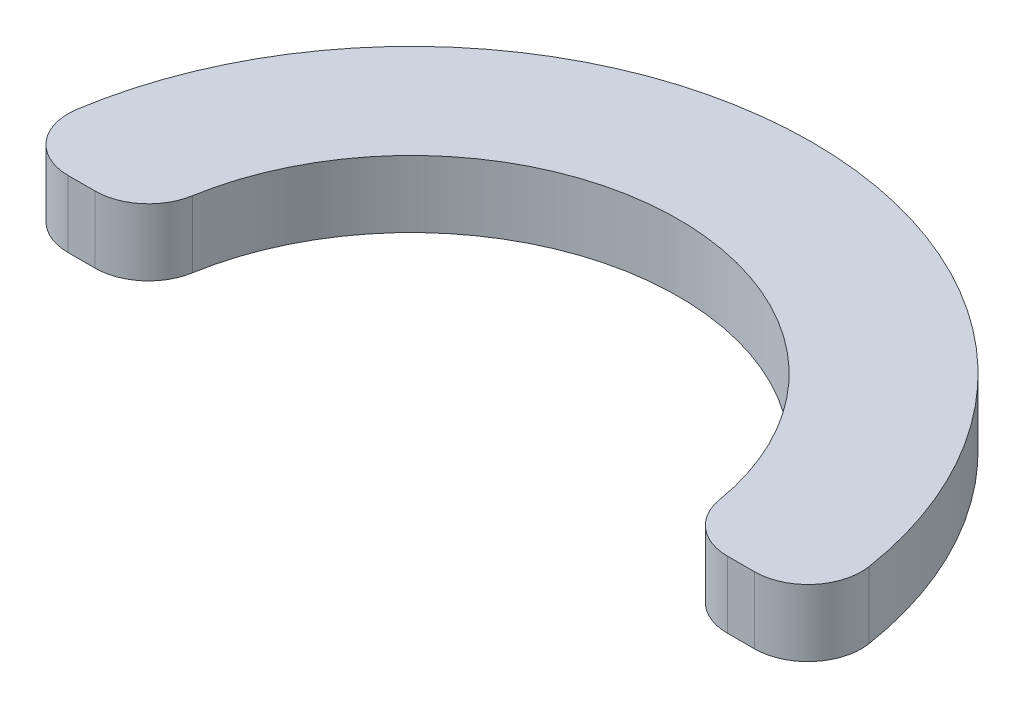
ISO-10303-21;
HEADER;
FILE_DESCRIPTION(('STEP AP214'),'2;1');
FILE_NAME('part.step','',(''),(''),'','','');
FILE_SCHEMA(('AUTOMOTIVE_DESIGN { 1 0 10303 214 1 1 1 1 }'));
ENDSEC;
DATA;
#1=APPLICATION_CONTEXT('core data for automotive mechanical design processes');
#2=APPLICATION_PROTOCOL_DEFINITION('international standard','automotive_design',2000,#1);
#3=PRODUCT_CONTEXT('',#1,'mechanical');
#4=PRODUCT('Part','Part','',(#3));
#5=PRODUCT_RELATED_PRODUCT_CATEGORY('part','',(#4));
#6=PRODUCT_DEFINITION_FORMATION('','',#4);
#7=PRODUCT_DEFINITION_CONTEXT('part definition',#1,'design');
#8=PRODUCT_DEFINITION('design','',#6,#7);
#9=PRODUCT_DEFINITION_SHAPE('','',#8);
#10=(LENGTH_UNIT() NAMED_UNIT(*) SI_UNIT(.MILLI.,.METRE.));
#11=(NAMED_UNIT(*) PLANE_ANGLE_UNIT() SI_UNIT($,.RADIAN.));
#12=(NAMED_UNIT(*) SI_UNIT($,.STERADIAN.) SOLID_ANGLE_UNIT());
#13=UNCERTAINTY_MEASURE_WITH_UNIT(LENGTH_MEASURE(1.E-05),#10,'distance_accuracy_value','');
#14=(GEOMETRIC_REPRESENTATION_CONTEXT(3) GLOBAL_UNCERTAINTY_ASSIGNED_CONTEXT((#13)) GLOBAL_UNIT_ASSIGNED_CONTEXT((#10,
#11,#12)) REPRESENTATION_CONTEXT('',''));
#15=CARTESIAN_POINT('',(0.,0.,0.));
#16=DIRECTION('',(0.,0.,1.));
#17=DIRECTION('',(1.,0.,0.));
#18=AXIS2_PLACEMENT_3D('',#15,#16,#17);
#19=CARTESIAN_POINT('',(0.,3.175,0.));
#20=DIRECTION('',(0.,-1.,0.));
#21=DIRECTION('',(0.,0.,-1.));
#22=AXIS2_PLACEMENT_3D('',#19,#20,#21);
#23=CYLINDRICAL_SURFACE('',#22,12.7);
#24=CARTESIAN_POINT('',(0.,3.175,0.));
#25=DIRECTION('',(0.,-1.,0.));
#26=DIRECTION('',(0.,0.,1.));
#27=AXIS2_PLACEMENT_3D('',#24,#25,#26);
#28=CIRCLE('',#27,12.7);
#29=CARTESIAN_POINT('',(-12.5223688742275,3.175,-2.11666666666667));
#30=VERTEX_POINT('',#29);
#31=CARTESIAN_POINT('',(12.5223688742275,3.175,-2.11666666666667));
#32=VERTEX_POINT('',#31);
#33=EDGE_CURVE('E140',#30,#32,#28,.T.);
#34=ORIENTED_EDGE('',*,*,#33,.F.);
#35=DIRECTION('',(0.,-1.,0.));
#36=VECTOR('',#35,1.);
#37=CARTESIAN_POINT('',(-12.5223688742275,3.175,-2.11666666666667));
#38=LINE('',#37,#36);
#39=CARTESIAN_POINT('',(-12.5223688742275,0.,-2.11666666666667));
#40=VERTEX_POINT('',#39);
#41=EDGE_CURVE('E179',#30,#40,#38,.T.);
#42=ORIENTED_EDGE('',*,*,#41,.T.);
#43=CARTESIAN_POINT('',(0.,0.,0.));
#44=DIRECTION('',(0.,-1.,0.));
#45=DIRECTION('',(0.,0.,1.));
#46=AXIS2_PLACEMENT_3D('',#43,#44,#45);
#47=CIRCLE('',#46,12.7);
#48=CARTESIAN_POINT('',(12.5223688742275,0.,-2.11666666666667));
#49=VERTEX_POINT('',#48);
#50=EDGE_CURVE('E193',#40,#49,#47,.T.);
#51=ORIENTED_EDGE('',*,*,#50,.T.);
#52=DIRECTION('',(0.,-1.,0.));
#53=VECTOR('',#52,1.);
#54=CARTESIAN_POINT('',(12.5223688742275,3.175,-2.11666666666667));
#55=LINE('',#54,#53);
#56=EDGE_CURVE('E176',#49,#32,#55,.F.);
#57=ORIENTED_EDGE('',*,*,#56,.T.);
#58=EDGE_LOOP('',(#34,#42,#51,#57));
#59=FACE_BOUND('',#58,.T.);
#60=ADVANCED_FACE('F44',(#59),#23,.F.);
#61=CARTESIAN_POINT('',(12.7,3.175,0.));
#62=DIRECTION('',(0.,0.,-1.));
#63=DIRECTION('',(-1.,0.,0.));
#64=AXIS2_PLACEMENT_3D('',#61,#62,#63);
#65=PLANE('',#64);
#66=DIRECTION('',(1.,0.,0.));
#67=VECTOR('',#66,1.);
#68=CARTESIAN_POINT('',(12.7,3.175,0.));
#69=LINE('',#68,#67);
#70=CARTESIAN_POINT('',(15.026842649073,3.175,0.));
#71=VERTEX_POINT('',#70);
#72=CARTESIAN_POINT('',(16.3134453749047,3.175,0.));
#73=VERTEX_POINT('',#72);
#74=EDGE_CURVE('E145',#71,#73,#69,.T.);
#75=ORIENTED_EDGE('',*,*,#74,.F.);
#76=DIRECTION('',(0.,-1.,0.));
#77=VECTOR('',#76,1.);
#78=CARTESIAN_POINT('',(15.026842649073,3.175,0.));
#79=LINE('',#78,#77);
#80=CARTESIAN_POINT('',(15.026842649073,0.,0.));
#81=VERTEX_POINT('',#80);
#82=EDGE_CURVE('E11',#71,#81,#79,.T.);
#83=ORIENTED_EDGE('',*,*,#82,.T.);
#84=DIRECTION('',(1.,0.,0.));
#85=VECTOR('',#84,1.);
#86=CARTESIAN_POINT('',(12.7,0.,0.));
#87=LINE('',#86,#85);
#88=CARTESIAN_POINT('',(16.3134453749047,0.,0.));
#89=VERTEX_POINT('',#88);
#90=EDGE_CURVE('E147',#81,#89,#87,.T.);
#91=ORIENTED_EDGE('',*,*,#90,.T.);
#92=DIRECTION('',(0.,-1.,0.));
#93=VECTOR('',#92,1.);
#94=CARTESIAN_POINT('',(16.3134453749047,3.175,0.));
#95=LINE('',#94,#93);
#96=EDGE_CURVE('E53',#89,#73,#95,.F.);
#97=ORIENTED_EDGE('',*,*,#96,.T.);
#98=EDGE_LOOP('',(#75,#83,#91,#97));
#99=FACE_BOUND('',#98,.T.);
#100=ADVANCED_FACE('F198',(#99),#65,.F.);
#101=CARTESIAN_POINT('',(0.,3.175,0.));
#102=DIRECTION('',(0.,-1.,0.));
#103=DIRECTION('',(0.,0.,-1.));
#104=AXIS2_PLACEMENT_3D('',#101,#102,#103);
#105=CYLINDRICAL_SURFACE('',#104,19.05);
#106=CARTESIAN_POINT('',(0.,0.,0.));
#107=DIRECTION('',(0.,1.,0.));
#108=DIRECTION('',(0.,0.,1.));
#109=AXIS2_PLACEMENT_3D('',#106,#107,#108);
#110=CIRCLE('',#109,19.05);
#111=CARTESIAN_POINT('',(18.8232062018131,0.,-2.93076923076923));
#112=VERTEX_POINT('',#111);
#113=CARTESIAN_POINT('',(-18.8232062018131,0.,-2.93076923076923));
#114=VERTEX_POINT('',#113);
#115=EDGE_CURVE('E141',#112,#114,#110,.T.);
#116=ORIENTED_EDGE('',*,*,#115,.T.);
#117=DIRECTION('',(0.,-1.,0.));
#118=VECTOR('',#117,1.);
#119=CARTESIAN_POINT('',(-18.8232062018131,3.175,-2.93076923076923));
#120=LINE('',#119,#118);
#121=CARTESIAN_POINT('',(-18.8232062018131,3.175,-2.93076923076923));
#122=VERTEX_POINT('',#121);
#123=EDGE_CURVE('E116',#114,#122,#120,.F.);
#124=ORIENTED_EDGE('',*,*,#123,.T.);
#125=CARTESIAN_POINT('',(0.,3.175,0.));
#126=DIRECTION('',(0.,1.,0.));
#127=DIRECTION('',(0.,0.,1.));
#128=AXIS2_PLACEMENT_3D('',#125,#126,#127);
#129=CIRCLE('',#128,19.05);
#130=CARTESIAN_POINT('',(18.8232062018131,3.175,-2.93076923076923));
#131=VERTEX_POINT('',#130);
#132=EDGE_CURVE('E185',#131,#122,#129,.T.);
#133=ORIENTED_EDGE('',*,*,#132,.F.);
#134=DIRECTION('',(0.,-1.,0.));
#135=VECTOR('',#134,1.);
#136=CARTESIAN_POINT('',(18.8232062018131,3.175,-2.93076923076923));
#137=LINE('',#136,#135);
#138=EDGE_CURVE('E122',#131,#112,#137,.T.);
#139=ORIENTED_EDGE('',*,*,#138,.T.);
#140=EDGE_LOOP('',(#116,#124,#133,#139));
#141=FACE_BOUND('',#140,.T.);
#142=ADVANCED_FACE('F205',(#141),#105,.T.);
#143=CARTESIAN_POINT('',(-12.7,3.175,0.));
#144=DIRECTION('',(0.,0.,-1.));
#145=DIRECTION('',(-1.,0.,0.));
#146=AXIS2_PLACEMENT_3D('',#143,#144,#145);
#147=PLANE('',#146);
#148=DIRECTION('',(1.,0.,0.));
#149=VECTOR('',#148,1.);
#150=CARTESIAN_POINT('',(-12.7,3.175,0.));
#151=LINE('',#150,#149);
#152=CARTESIAN_POINT('',(-16.3134453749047,3.175,0.));
#153=VERTEX_POINT('',#152);
#154=CARTESIAN_POINT('',(-15.026842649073,3.175,0.));
#155=VERTEX_POINT('',#154);
#156=EDGE_CURVE('E132',#153,#155,#151,.T.);
#157=ORIENTED_EDGE('',*,*,#156,.F.);
#158=DIRECTION('',(0.,-1.,0.));
#159=VECTOR('',#158,1.);
#160=CARTESIAN_POINT('',(-16.3134453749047,3.175,0.));
#161=LINE('',#160,#159);
#162=CARTESIAN_POINT('',(-16.3134453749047,0.,0.));
#163=VERTEX_POINT('',#162);
#164=EDGE_CURVE('E115',#153,#163,#161,.T.);
#165=ORIENTED_EDGE('',*,*,#164,.T.);
#166=DIRECTION('',(1.,0.,0.));
#167=VECTOR('',#166,1.);
#168=CARTESIAN_POINT('',(-12.7,0.,0.));
#169=LINE('',#168,#167);
#170=CARTESIAN_POINT('',(-15.026842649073,0.,0.));
#171=VERTEX_POINT('',#170);
#172=EDGE_CURVE('E129',#163,#171,#169,.T.);
#173=ORIENTED_EDGE('',*,*,#172,.T.);
#174=DIRECTION('',(0.,-1.,0.));
#175=VECTOR('',#174,1.);
#176=CARTESIAN_POINT('',(-15.026842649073,3.175,0.));
#177=LINE('',#176,#175);
#178=EDGE_CURVE('E135',#171,#155,#177,.F.);
#179=ORIENTED_EDGE('',*,*,#178,.T.);
#180=EDGE_LOOP('',(#157,#165,#173,#179));
#181=FACE_BOUND('',#180,.T.);
#182=ADVANCED_FACE('F128',(#181),#147,.F.);
#183=CARTESIAN_POINT('',(0.,3.175,0.));
#184=DIRECTION('',(0.,1.,0.));
#185=DIRECTION('',(0.,0.,1.));
#186=AXIS2_PLACEMENT_3D('',#183,#184,#185);
#187=PLANE('',#186);
#188=ORIENTED_EDGE('',*,*,#132,.T.);
#189=CARTESIAN_POINT('',(-16.3134453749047,3.175,-2.54));
#190=DIRECTION('',(0.,1.,0.));
#191=DIRECTION('',(0.,0.,1.));
#192=AXIS2_PLACEMENT_3D('',#189,#190,#191);
#193=CIRCLE('',#192,2.54);
#194=EDGE_CURVE('E173',#122,#153,#193,.T.);
#195=ORIENTED_EDGE('',*,*,#194,.T.);
#196=ORIENTED_EDGE('',*,*,#156,.T.);
#197=CARTESIAN_POINT('',(-15.026842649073,3.175,-2.54));
#198=DIRECTION('',(0.,1.,0.));
#199=DIRECTION('',(0.,0.,1.));
#200=AXIS2_PLACEMENT_3D('',#197,#198,#199);
#201=CIRCLE('',#200,2.54);
#202=EDGE_CURVE('E170',#155,#30,#201,.T.);
#203=ORIENTED_EDGE('',*,*,#202,.T.);
#204=ORIENTED_EDGE('',*,*,#33,.T.);
#205=CARTESIAN_POINT('',(15.026842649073,3.175,-2.54));
#206=DIRECTION('',(0.,1.,0.));
#207=DIRECTION('',(0.,0.,1.));
#208=AXIS2_PLACEMENT_3D('',#205,#206,#207);
#209=CIRCLE('',#208,2.54);
#210=EDGE_CURVE('E66',#32,#71,#209,.T.);
#211=ORIENTED_EDGE('',*,*,#210,.T.);
#212=ORIENTED_EDGE('',*,*,#74,.T.);
#213=CARTESIAN_POINT('',(16.3134453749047,3.175,-2.54));
#214=DIRECTION('',(0.,1.,0.));
#215=DIRECTION('',(0.,0.,1.));
#216=AXIS2_PLACEMENT_3D('',#213,#214,#215);
#217=CIRCLE('',#216,2.54);
#218=EDGE_CURVE('E165',#73,#131,#217,.T.);
#219=ORIENTED_EDGE('',*,*,#218,.T.);
#220=EDGE_LOOP('',(#188,#195,#196,#203,#204,#211,#212,#219));
#221=FACE_BOUND('',#220,.T.);
#222=ADVANCED_FACE('F203',(#221),#187,.T.);
#223=CARTESIAN_POINT('',(0.,0.,0.));
#224=DIRECTION('',(0.,1.,0.));
#225=DIRECTION('',(0.,0.,1.));
#226=AXIS2_PLACEMENT_3D('',#223,#224,#225);
#227=PLANE('',#226);
#228=ORIENTED_EDGE('',*,*,#172,.F.);
#229=CARTESIAN_POINT('',(-16.3134453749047,0.,-2.54));
#230=DIRECTION('',(0.,1.,0.));
#231=DIRECTION('',(0.,0.,1.));
#232=AXIS2_PLACEMENT_3D('',#229,#230,#231);
#233=CIRCLE('',#232,2.54);
#234=EDGE_CURVE('E111',#163,#114,#233,.F.);
#235=ORIENTED_EDGE('',*,*,#234,.T.);
#236=ORIENTED_EDGE('',*,*,#115,.F.);
#237=CARTESIAN_POINT('',(16.3134453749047,0.,-2.54));
#238=DIRECTION('',(0.,1.,0.));
#239=DIRECTION('',(0.,0.,1.));
#240=AXIS2_PLACEMENT_3D('',#237,#238,#239);
#241=CIRCLE('',#240,2.54);
#242=EDGE_CURVE('E134',#112,#89,#241,.F.);
#243=ORIENTED_EDGE('',*,*,#242,.T.);
#244=ORIENTED_EDGE('',*,*,#90,.F.);
#245=CARTESIAN_POINT('',(15.026842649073,0.,-2.54));
#246=DIRECTION('',(0.,1.,0.));
#247=DIRECTION('',(0.,0.,1.));
#248=AXIS2_PLACEMENT_3D('',#245,#246,#247);
#249=CIRCLE('',#248,2.54);
#250=EDGE_CURVE('E155',#81,#49,#249,.F.);
#251=ORIENTED_EDGE('',*,*,#250,.T.);
#252=ORIENTED_EDGE('',*,*,#50,.F.);
#253=CARTESIAN_POINT('',(-15.026842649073,0.,-2.54));
#254=DIRECTION('',(0.,1.,0.));
#255=DIRECTION('',(0.,0.,1.));
#256=AXIS2_PLACEMENT_3D('',#253,#254,#255);
#257=CIRCLE('',#256,2.54);
#258=EDGE_CURVE('E123',#40,#171,#257,.F.);
#259=ORIENTED_EDGE('',*,*,#258,.T.);
#260=EDGE_LOOP('',(#228,#235,#236,#243,#244,#251,#252,#259));
#261=FACE_BOUND('',#260,.T.);
#262=ADVANCED_FACE('F137',(#261),#227,.F.);
#263=CARTESIAN_POINT('',(-16.3134453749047,3.175,-2.54));
#264=DIRECTION('',(0.,-1.,0.));
#265=DIRECTION('',(0.,0.,-1.));
#266=AXIS2_PLACEMENT_3D('',#263,#264,#265);
#267=CYLINDRICAL_SURFACE('',#266,2.54);
#268=ORIENTED_EDGE('',*,*,#194,.F.);
#269=ORIENTED_EDGE('',*,*,#123,.F.);
#270=ORIENTED_EDGE('',*,*,#234,.F.);
#271=ORIENTED_EDGE('',*,*,#164,.F.);
#272=EDGE_LOOP('',(#268,#269,#270,#271));
#273=FACE_BOUND('',#272,.T.);
#274=ADVANCED_FACE('F114',(#273),#267,.T.);
#275=CARTESIAN_POINT('',(-15.026842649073,3.175,-2.54));
#276=DIRECTION('',(0.,-1.,0.));
#277=DIRECTION('',(0.,0.,-1.));
#278=AXIS2_PLACEMENT_3D('',#275,#276,#277);
#279=CYLINDRICAL_SURFACE('',#278,2.54);
#280=ORIENTED_EDGE('',*,*,#202,.F.);
#281=ORIENTED_EDGE('',*,*,#178,.F.);
#282=ORIENTED_EDGE('',*,*,#258,.F.);
#283=ORIENTED_EDGE('',*,*,#41,.F.);
#284=EDGE_LOOP('',(#280,#281,#282,#283));
#285=FACE_BOUND('',#284,.T.);
#286=ADVANCED_FACE('F223',(#285),#279,.T.);
#287=CARTESIAN_POINT('',(15.026842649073,3.175,-2.54));
#288=DIRECTION('',(0.,-1.,0.));
#289=DIRECTION('',(0.,0.,-1.));
#290=AXIS2_PLACEMENT_3D('',#287,#288,#289);
#291=CYLINDRICAL_SURFACE('',#290,2.54);
#292=ORIENTED_EDGE('',*,*,#210,.F.);
#293=ORIENTED_EDGE('',*,*,#56,.F.);
#294=ORIENTED_EDGE('',*,*,#250,.F.);
#295=ORIENTED_EDGE('',*,*,#82,.F.);
#296=EDGE_LOOP('',(#292,#293,#294,#295));
#297=FACE_BOUND('',#296,.T.);
#298=ADVANCED_FACE('F225',(#297),#291,.T.);
#299=CARTESIAN_POINT('',(16.3134453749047,3.175,-2.54));
#300=DIRECTION('',(0.,-1.,0.));
#301=DIRECTION('',(0.,0.,-1.));
#302=AXIS2_PLACEMENT_3D('',#299,#300,#301);
#303=CYLINDRICAL_SURFACE('',#302,2.54);
#304=ORIENTED_EDGE('',*,*,#218,.F.);
#305=ORIENTED_EDGE('',*,*,#96,.F.);
#306=ORIENTED_EDGE('',*,*,#242,.F.);
#307=ORIENTED_EDGE('',*,*,#138,.F.);
#308=EDGE_LOOP('',(#304,#305,#306,#307));
#309=FACE_BOUND('',#308,.T.);
#310=ADVANCED_FACE('F46',(#309),#303,.T.);
#311=CLOSED_SHELL('',(#60,#100,#142,#182,#222,#262,#274,#286,#298,#310));
#312=MANIFOLD_SOLID_BREP('B2',#311);
#313=ADVANCED_BREP_SHAPE_REPRESENTATION('',(#18,#312),#14);
#314=SHAPE_DEFINITION_REPRESENTATION(#9,#313);
ENDSEC;
END-ISO-10303-21;
